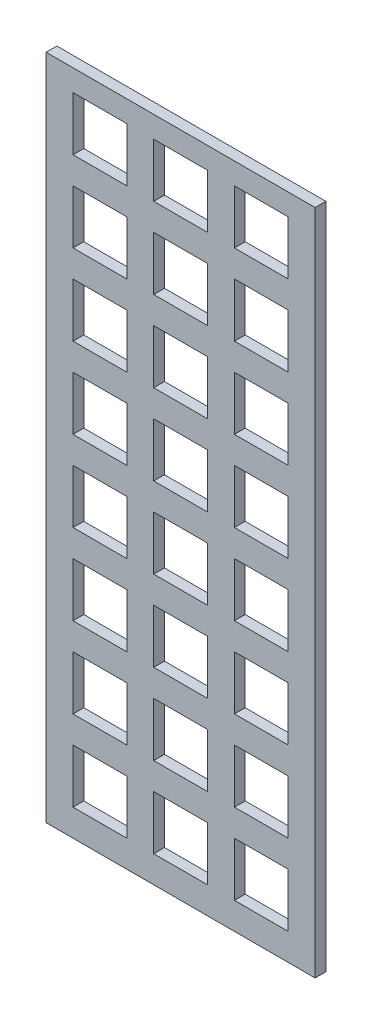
from build123d import *

# Parameters (mm, degrees)
SKETCH1_W      = 25
SKETCH1_H      = 62
EXTRUDE1_DEPTH = 1
SKETCH2_W      = 5
SKETCH2_H      = 5
EXTRUDE2_DEPTH = 1


with BuildPart() as part:
    # Sketch1 → Extrude1 (new body)
    with BuildSketch(Plane.XY):
        with Locations((12.5, 31)):
            Rectangle(SKETCH1_W, SKETCH1_H)
    extrude(amount=EXTRUDE1_DEPTH)

    # Sketch2 → Extrude2 (cut)
    with BuildSketch(Plane.XY.offset(1)):
        with Locations((20, 5)):
            Rectangle(SKETCH2_W, SKETCH2_H)
        with Locations((12.5, 5)):
            Rectangle(SKETCH2_W, SKETCH2_H)
        with Locations((5, 5)):
            Rectangle(SKETCH2_W, SKETCH2_H)
        with Locations((20, 12.5)):
            Rectangle(SKETCH2_W, SKETCH2_H)
        with Locations((12.5, 12.5)):
            Rectangle(SKETCH2_W, SKETCH2_H)
        with Locations((5, 12.5)):
            Rectangle(SKETCH2_W, SKETCH2_H)
        with Locations((20, 20)):
            Rectangle(SKETCH2_W, SKETCH2_H)
        with Locations((12.5, 20)):
            Rectangle(SKETCH2_W, SKETCH2_H)
        with Locations((5, 20)):
            Rectangle(SKETCH2_W, SKETCH2_H)
        with Locations((20, 27.5)):
            Rectangle(SKETCH2_W, SKETCH2_H)
        with Locations((12.5, 27.5)):
            Rectangle(SKETCH2_W, SKETCH2_H)
        with Locations((5, 27.5)):
            Rectangle(SKETCH2_W, SKETCH2_H)
        with Locations((20, 35)):
            Rectangle(SKETCH2_W, SKETCH2_H)
        with Locations((12.5, 35)):
            Rectangle(SKETCH2_W, SKETCH2_H)
        with Locations((5, 35)):
            Rectangle(SKETCH2_W, SKETCH2_H)
        with Locations((20, 42.5)):
            Rectangle(SKETCH2_W, SKETCH2_H)
        with Locations((12.5, 42.5)):
            Rectangle(SKETCH2_W, SKETCH2_H)
        with Locations((5, 42.5)):
            Rectangle(SKETCH2_W, SKETCH2_H)
        with Locations((20, 50)):
            Rectangle(SKETCH2_W, SKETCH2_H)
        with Locations((12.5, 50)):
            Rectangle(SKETCH2_W, SKETCH2_H)
        with Locations((5, 50)):
            Rectangle(SKETCH2_W, SKETCH2_H)
        with Locations((20, 57.5)):
            Rectangle(SKETCH2_W, SKETCH2_H)
        with Locations((12.5, 57.5)):
            Rectangle(SKETCH2_W, SKETCH2_H)
        with Locations((5, 57.5)):
            Rectangle(SKETCH2_W, SKETCH2_H)
    extrude(amount=-EXTRUDE2_DEPTH, mode=Mode.SUBTRACT)


solid = part.part
